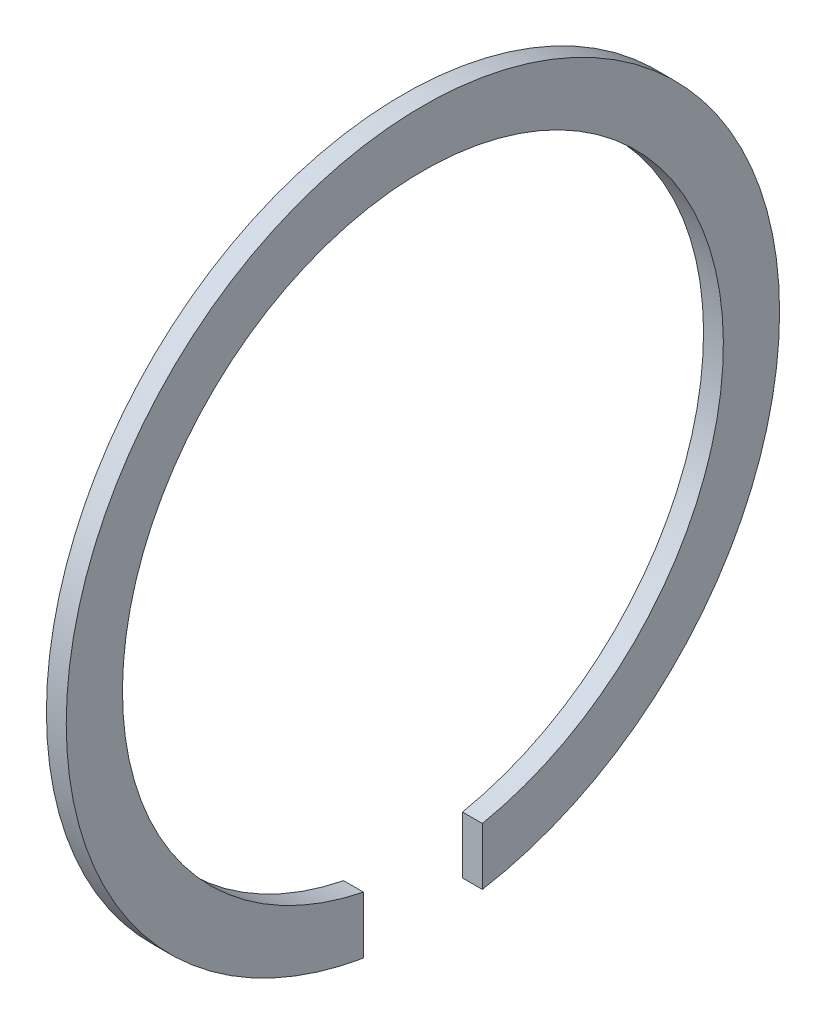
from build123d import *

# Parameters (mm, degrees)
ESQUISSE1_W             = 4
ESQUISSE1_H             = 11.35
ESQUISSE3_W             = 24
ESQUISSE3_H             = 413.570380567
ENL_V_MAT_EXTRU_1_DEPTH = 102.901913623


with BuildPart() as part:
    # Esquisse1 → R_volution1 (revolve)
    with BuildSketch(Plane.XY, mode=Mode.PRIVATE) as r_volution1_sk:
        with Locations((-2, 66.325)):
            Rectangle(ESQUISSE1_W, ESQUISSE1_H)
    revolve(r_volution1_sk.sketch.rotate(Axis((0, 0, 0), (-1, 0, 0)), 90), axis=Axis((0, 0, 0), (-1, 0, 0)))

    # Esquisse3 → Enl_v. mat.-Extru.1 (cut, through all)
    with BuildSketch(Plane(origin=(0, 0, 0), x_dir=(0, 0, -1), z_dir=(1, 0, 0))):
        with Locations((0, -207.095603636)):
            Rectangle(ESQUISSE3_W, ESQUISSE3_H)
    extrude(amount=-ENL_V_MAT_EXTRU_1_DEPTH, mode=Mode.SUBTRACT)


solid = part.part
